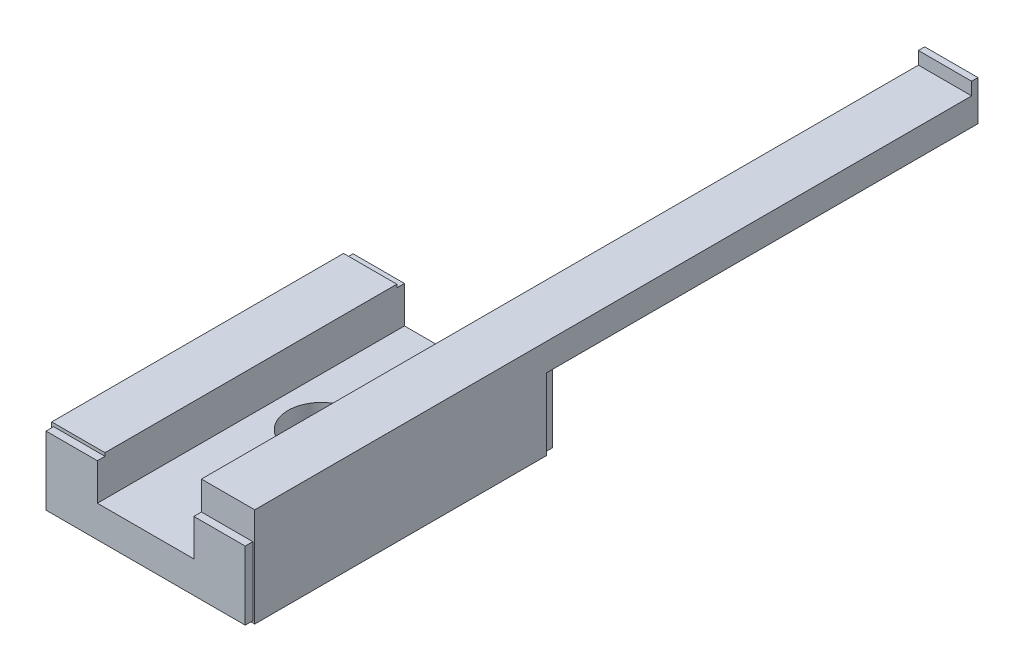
ISO-10303-21;
HEADER;
FILE_DESCRIPTION(('STEP AP214'),'2;1');
FILE_NAME('part.step','',(''),(''),'','','');
FILE_SCHEMA(('AUTOMOTIVE_DESIGN { 1 0 10303 214 1 1 1 1 }'));
ENDSEC;
DATA;
#1=APPLICATION_CONTEXT('core data for automotive mechanical design processes');
#2=APPLICATION_PROTOCOL_DEFINITION('international standard','automotive_design',2000,#1);
#3=PRODUCT_CONTEXT('',#1,'mechanical');
#4=PRODUCT('Part','Part','',(#3));
#5=PRODUCT_RELATED_PRODUCT_CATEGORY('part','',(#4));
#6=PRODUCT_DEFINITION_FORMATION('','',#4);
#7=PRODUCT_DEFINITION_CONTEXT('part definition',#1,'design');
#8=PRODUCT_DEFINITION('design','',#6,#7);
#9=PRODUCT_DEFINITION_SHAPE('','',#8);
#10=(LENGTH_UNIT() NAMED_UNIT(*) SI_UNIT(.MILLI.,.METRE.));
#11=(NAMED_UNIT(*) PLANE_ANGLE_UNIT() SI_UNIT($,.RADIAN.));
#12=(NAMED_UNIT(*) SI_UNIT($,.STERADIAN.) SOLID_ANGLE_UNIT());
#13=UNCERTAINTY_MEASURE_WITH_UNIT(LENGTH_MEASURE(1.E-05),#10,'distance_accuracy_value','');
#14=(GEOMETRIC_REPRESENTATION_CONTEXT(3) GLOBAL_UNCERTAINTY_ASSIGNED_CONTEXT((#13)) GLOBAL_UNIT_ASSIGNED_CONTEXT((#10,
#11,#12)) REPRESENTATION_CONTEXT('',''));
#15=CARTESIAN_POINT('',(0.,0.,0.));
#16=DIRECTION('',(0.,0.,1.));
#17=DIRECTION('',(1.,0.,0.));
#18=AXIS2_PLACEMENT_3D('',#15,#16,#17);
#19=CARTESIAN_POINT('',(7.6,15.6,47.2));
#20=DIRECTION('',(0.,1.,0.));
#21=DIRECTION('',(1.,0.,0.));
#22=AXIS2_PLACEMENT_3D('',#19,#20,#21);
#23=PLANE('',#22);
#24=DIRECTION('',(-1.,0.,0.));
#25=VECTOR('',#24,1.);
#26=CARTESIAN_POINT('',(16.,15.6,-65.8));
#27=LINE('',#26,#25);
#28=CARTESIAN_POINT('',(7.6,15.6,-65.8));
#29=VERTEX_POINT('',#28);
#30=CARTESIAN_POINT('',(16.,15.6,-65.8));
#31=VERTEX_POINT('',#30);
#32=EDGE_CURVE('E197',#29,#31,#27,.F.);
#33=ORIENTED_EDGE('',*,*,#32,.F.);
#34=DIRECTION('',(0.,0.,1.));
#35=VECTOR('',#34,1.);
#36=CARTESIAN_POINT('',(7.6,15.6,-65.8));
#37=LINE('',#36,#35);
#38=CARTESIAN_POINT('',(7.6,15.6,47.2));
#39=VERTEX_POINT('',#38);
#40=EDGE_CURVE('E212',#39,#29,#37,.F.);
#41=ORIENTED_EDGE('',*,*,#40,.F.);
#42=DIRECTION('',(1.,0.,0.));
#43=VECTOR('',#42,1.);
#44=CARTESIAN_POINT('',(7.6,15.6,47.2));
#45=LINE('',#44,#43);
#46=CARTESIAN_POINT('',(16.,15.6,47.2));
#47=VERTEX_POINT('',#46);
#48=EDGE_CURVE('E221',#47,#39,#45,.F.);
#49=ORIENTED_EDGE('',*,*,#48,.F.);
#50=DIRECTION('',(0.,0.,-1.));
#51=VECTOR('',#50,1.);
#52=CARTESIAN_POINT('',(16.,15.6,47.2));
#53=LINE('',#52,#51);
#54=EDGE_CURVE('E214',#47,#31,#53,.T.);
#55=ORIENTED_EDGE('',*,*,#54,.T.);
#56=EDGE_LOOP('',(#33,#41,#49,#55));
#57=FACE_BOUND('',#56,.T.);
#58=ADVANCED_FACE('F16',(#57),#23,.T.);
#59=CARTESIAN_POINT('',(-16.,11.6,47.2));
#60=DIRECTION('',(0.,1.,0.));
#61=DIRECTION('',(1.,0.,0.));
#62=AXIS2_PLACEMENT_3D('',#59,#60,#61);
#63=PLANE('',#62);
#64=DIRECTION('',(1.,0.,0.));
#65=VECTOR('',#64,1.);
#66=CARTESIAN_POINT('',(-16.,11.6,47.2));
#67=LINE('',#66,#65);
#68=CARTESIAN_POINT('',(-7.6,11.6,47.2));
#69=VERTEX_POINT('',#68);
#70=CARTESIAN_POINT('',(-16.,11.6,47.2));
#71=VERTEX_POINT('',#70);
#72=EDGE_CURVE('E232',#69,#71,#67,.F.);
#73=ORIENTED_EDGE('',*,*,#72,.F.);
#74=DIRECTION('',(0.,0.,-1.));
#75=VECTOR('',#74,1.);
#76=CARTESIAN_POINT('',(-7.6,11.6,47.2));
#77=LINE('',#76,#75);
#78=CARTESIAN_POINT('',(-7.6,11.6,1.2));
#79=VERTEX_POINT('',#78);
#80=EDGE_CURVE('E236',#69,#79,#77,.T.);
#81=ORIENTED_EDGE('',*,*,#80,.T.);
#82=DIRECTION('',(-1.,0.,0.));
#83=VECTOR('',#82,1.);
#84=CARTESIAN_POINT('',(-7.6,11.6,1.2));
#85=LINE('',#84,#83);
#86=CARTESIAN_POINT('',(-16.,11.6,1.2));
#87=VERTEX_POINT('',#86);
#88=EDGE_CURVE('E241',#79,#87,#85,.T.);
#89=ORIENTED_EDGE('',*,*,#88,.T.);
#90=DIRECTION('',(0.,0.,1.));
#91=VECTOR('',#90,1.);
#92=CARTESIAN_POINT('',(-16.,11.6,1.2));
#93=LINE('',#92,#91);
#94=EDGE_CURVE('E246',#71,#87,#93,.F.);
#95=ORIENTED_EDGE('',*,*,#94,.F.);
#96=EDGE_LOOP('',(#73,#81,#89,#95));
#97=FACE_BOUND('',#96,.T.);
#98=ADVANCED_FACE('F638',(#97),#63,.T.);
#99=CARTESIAN_POINT('',(-16.,0.,47.2));
#100=DIRECTION('',(-1.,0.,0.));
#101=DIRECTION('',(0.,1.,0.));
#102=AXIS2_PLACEMENT_3D('',#99,#100,#101);
#103=PLANE('',#102);
#104=DIRECTION('',(0.,1.,0.));
#105=VECTOR('',#104,1.);
#106=CARTESIAN_POINT('',(-16.,0.,47.2));
#107=LINE('',#106,#105);
#108=CARTESIAN_POINT('',(-16.,0.,47.2));
#109=VERTEX_POINT('',#108);
#110=EDGE_CURVE('E251',#71,#109,#107,.F.);
#111=ORIENTED_EDGE('',*,*,#110,.F.);
#112=ORIENTED_EDGE('',*,*,#94,.T.);
#113=DIRECTION('',(0.,-1.,0.));
#114=VECTOR('',#113,1.);
#115=CARTESIAN_POINT('',(-16.,11.6,1.2));
#116=LINE('',#115,#114);
#117=CARTESIAN_POINT('',(-16.,0.,1.2));
#118=VERTEX_POINT('',#117);
#119=EDGE_CURVE('E255',#87,#118,#116,.T.);
#120=ORIENTED_EDGE('',*,*,#119,.T.);
#121=DIRECTION('',(0.,0.,1.));
#122=VECTOR('',#121,1.);
#123=CARTESIAN_POINT('',(-16.,0.,1.2));
#124=LINE('',#123,#122);
#125=EDGE_CURVE('E260',#109,#118,#124,.F.);
#126=ORIENTED_EDGE('',*,*,#125,.F.);
#127=EDGE_LOOP('',(#111,#112,#120,#126));
#128=FACE_BOUND('',#127,.T.);
#129=ADVANCED_FACE('F643',(#128),#103,.T.);
#130=CARTESIAN_POINT('',(-16.,0.,1.2));
#131=DIRECTION('',(0.,-1.,0.));
#132=DIRECTION('',(1.,0.,0.));
#133=AXIS2_PLACEMENT_3D('',#130,#131,#132);
#134=PLANE('',#133);
#135=DIRECTION('',(-1.,0.,0.));
#136=VECTOR('',#135,1.);
#137=CARTESIAN_POINT('',(-8.,0.,47.2));
#138=LINE('',#137,#136);
#139=CARTESIAN_POINT('',(-8.,0.,47.2));
#140=VERTEX_POINT('',#139);
#141=EDGE_CURVE('E265',#109,#140,#138,.F.);
#142=ORIENTED_EDGE('',*,*,#141,.F.);
#143=ORIENTED_EDGE('',*,*,#125,.T.);
#144=DIRECTION('',(1.,0.,0.));
#145=VECTOR('',#144,1.);
#146=CARTESIAN_POINT('',(-16.,0.,1.2));
#147=LINE('',#146,#145);
#148=CARTESIAN_POINT('',(-8.,0.,1.2));
#149=VERTEX_POINT('',#148);
#150=EDGE_CURVE('E269',#118,#149,#147,.T.);
#151=ORIENTED_EDGE('',*,*,#150,.T.);
#152=DIRECTION('',(0.,0.,1.));
#153=VECTOR('',#152,1.);
#154=CARTESIAN_POINT('',(-8.,0.,1.2));
#155=LINE('',#154,#153);
#156=EDGE_CURVE('E274',#140,#149,#155,.F.);
#157=ORIENTED_EDGE('',*,*,#156,.F.);
#158=EDGE_LOOP('',(#142,#143,#151,#157));
#159=FACE_BOUND('',#158,.T.);
#160=CARTESIAN_POINT('',(-12.,0.,9.2));
#161=DIRECTION('',(0.,1.,0.));
#162=DIRECTION('',(0.,0.,-1.));
#163=AXIS2_PLACEMENT_3D('',#160,#161,#162);
#164=CIRCLE('',#163,2.);
#165=CARTESIAN_POINT('',(-12.,0.,7.2));
#166=VERTEX_POINT('',#165);
#167=EDGE_CURVE('E279',#166,#166,#164,.F.);
#168=ORIENTED_EDGE('',*,*,#167,.F.);
#169=EDGE_LOOP('',(#168));
#170=FACE_BOUND('',#169,.T.);
#171=CARTESIAN_POINT('',(-12.,0.,39.2));
#172=DIRECTION('',(0.,1.,0.));
#173=DIRECTION('',(0.,0.,-1.));
#174=AXIS2_PLACEMENT_3D('',#171,#172,#173);
#175=CIRCLE('',#174,2.);
#176=CARTESIAN_POINT('',(-12.,0.,37.2));
#177=VERTEX_POINT('',#176);
#178=EDGE_CURVE('E284',#177,#177,#175,.F.);
#179=ORIENTED_EDGE('',*,*,#178,.F.);
#180=EDGE_LOOP('',(#179));
#181=FACE_BOUND('',#180,.T.);
#182=ADVANCED_FACE('F649',(#159,#170,#181),#134,.T.);
#183=CARTESIAN_POINT('',(-7.7,0.300000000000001,1.2));
#184=DIRECTION('',(0.707106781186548,-0.707106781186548,0.));
#185=DIRECTION('',(0.,0.,1.));
#186=AXIS2_PLACEMENT_3D('',#183,#184,#185);
#187=PLANE('',#186);
#188=DIRECTION('',(-0.707106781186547,-0.707106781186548,0.));
#189=VECTOR('',#188,1.);
#190=CARTESIAN_POINT('',(-7.7,0.300000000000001,47.2));
#191=LINE('',#190,#189);
#192=CARTESIAN_POINT('',(-7.7,0.300000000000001,47.2));
#193=VERTEX_POINT('',#192);
#194=EDGE_CURVE('E287',#140,#193,#191,.F.);
#195=ORIENTED_EDGE('',*,*,#194,.F.);
#196=ORIENTED_EDGE('',*,*,#156,.T.);
#197=DIRECTION('',(0.707106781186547,0.707106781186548,0.));
#198=VECTOR('',#197,1.);
#199=CARTESIAN_POINT('',(-8.,0.,1.2));
#200=LINE('',#199,#198);
#201=CARTESIAN_POINT('',(-7.7,0.300000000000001,1.2));
#202=VERTEX_POINT('',#201);
#203=EDGE_CURVE('E289',#149,#202,#200,.T.);
#204=ORIENTED_EDGE('',*,*,#203,.T.);
#205=DIRECTION('',(0.,0.,1.));
#206=VECTOR('',#205,1.);
#207=CARTESIAN_POINT('',(-7.7,0.300000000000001,1.2));
#208=LINE('',#207,#206);
#209=EDGE_CURVE('E294',#193,#202,#208,.F.);
#210=ORIENTED_EDGE('',*,*,#209,.F.);
#211=EDGE_LOOP('',(#195,#196,#204,#210));
#212=FACE_BOUND('',#211,.T.);
#213=ADVANCED_FACE('F653',(#212),#187,.T.);
#214=CARTESIAN_POINT('',(8.,0.,1.2));
#215=DIRECTION('',(-0.707106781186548,-0.707106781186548,0.));
#216=DIRECTION('',(0.,0.,1.));
#217=AXIS2_PLACEMENT_3D('',#214,#215,#216);
#218=PLANE('',#217);
#219=DIRECTION('',(-0.707106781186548,0.707106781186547,0.));
#220=VECTOR('',#219,1.);
#221=CARTESIAN_POINT('',(8.,0.,47.2));
#222=LINE('',#221,#220);
#223=CARTESIAN_POINT('',(7.7,0.3,47.2));
#224=VERTEX_POINT('',#223);
#225=CARTESIAN_POINT('',(8.,0.,47.2));
#226=VERTEX_POINT('',#225);
#227=EDGE_CURVE('E299',#224,#226,#222,.F.);
#228=ORIENTED_EDGE('',*,*,#227,.F.);
#229=DIRECTION('',(0.,0.,-1.));
#230=VECTOR('',#229,1.);
#231=CARTESIAN_POINT('',(7.7,0.3,47.2));
#232=LINE('',#231,#230);
#233=CARTESIAN_POINT('',(7.7,0.299999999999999,1.2));
#234=VERTEX_POINT('',#233);
#235=EDGE_CURVE('E303',#224,#234,#232,.T.);
#236=ORIENTED_EDGE('',*,*,#235,.T.);
#237=DIRECTION('',(0.707106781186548,-0.707106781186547,0.));
#238=VECTOR('',#237,1.);
#239=CARTESIAN_POINT('',(7.7,0.299999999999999,1.2));
#240=LINE('',#239,#238);
#241=CARTESIAN_POINT('',(8.,0.,1.2));
#242=VERTEX_POINT('',#241);
#243=EDGE_CURVE('E308',#234,#242,#240,.T.);
#244=ORIENTED_EDGE('',*,*,#243,.T.);
#245=DIRECTION('',(0.,0.,1.));
#246=VECTOR('',#245,1.);
#247=CARTESIAN_POINT('',(8.,0.,1.2));
#248=LINE('',#247,#246);
#249=EDGE_CURVE('E313',#226,#242,#248,.F.);
#250=ORIENTED_EDGE('',*,*,#249,.F.);
#251=EDGE_LOOP('',(#228,#236,#244,#250));
#252=FACE_BOUND('',#251,.T.);
#253=ADVANCED_FACE('F657',(#252),#218,.T.);
#254=CARTESIAN_POINT('',(8.,0.,1.2));
#255=DIRECTION('',(0.,-1.,0.));
#256=DIRECTION('',(1.,0.,0.));
#257=AXIS2_PLACEMENT_3D('',#254,#255,#256);
#258=PLANE('',#257);
#259=DIRECTION('',(-1.,0.,0.));
#260=VECTOR('',#259,1.);
#261=CARTESIAN_POINT('',(16.,0.,47.2));
#262=LINE('',#261,#260);
#263=CARTESIAN_POINT('',(16.,0.,47.2));
#264=VERTEX_POINT('',#263);
#265=EDGE_CURVE('E318',#226,#264,#262,.F.);
#266=ORIENTED_EDGE('',*,*,#265,.F.);
#267=ORIENTED_EDGE('',*,*,#249,.T.);
#268=DIRECTION('',(1.,0.,0.));
#269=VECTOR('',#268,1.);
#270=CARTESIAN_POINT('',(8.,0.,1.2));
#271=LINE('',#270,#269);
#272=CARTESIAN_POINT('',(16.,0.,1.2));
#273=VERTEX_POINT('',#272);
#274=EDGE_CURVE('E322',#242,#273,#271,.T.);
#275=ORIENTED_EDGE('',*,*,#274,.T.);
#276=DIRECTION('',(0.,0.,1.));
#277=VECTOR('',#276,1.);
#278=CARTESIAN_POINT('',(16.,0.,1.2));
#279=LINE('',#278,#277);
#280=EDGE_CURVE('E327',#264,#273,#279,.F.);
#281=ORIENTED_EDGE('',*,*,#280,.F.);
#282=EDGE_LOOP('',(#266,#267,#275,#281));
#283=FACE_BOUND('',#282,.T.);
#284=CARTESIAN_POINT('',(12.,0.,9.2));
#285=DIRECTION('',(0.,1.,0.));
#286=DIRECTION('',(0.,0.,-1.));
#287=AXIS2_PLACEMENT_3D('',#284,#285,#286);
#288=CIRCLE('',#287,2.);
#289=CARTESIAN_POINT('',(12.,0.,7.2));
#290=VERTEX_POINT('',#289);
#291=EDGE_CURVE('E332',#290,#290,#288,.F.);
#292=ORIENTED_EDGE('',*,*,#291,.F.);
#293=EDGE_LOOP('',(#292));
#294=FACE_BOUND('',#293,.T.);
#295=CARTESIAN_POINT('',(12.,0.,39.2));
#296=DIRECTION('',(0.,1.,0.));
#297=DIRECTION('',(0.,0.,-1.));
#298=AXIS2_PLACEMENT_3D('',#295,#296,#297);
#299=CIRCLE('',#298,2.);
#300=CARTESIAN_POINT('',(12.,0.,37.2));
#301=VERTEX_POINT('',#300);
#302=EDGE_CURVE('E337',#301,#301,#299,.F.);
#303=ORIENTED_EDGE('',*,*,#302,.F.);
#304=EDGE_LOOP('',(#303));
#305=FACE_BOUND('',#304,.T.);
#306=ADVANCED_FACE('F661',(#283,#294,#305),#258,.T.);
#307=CARTESIAN_POINT('',(16.,0.,-66.8));
#308=DIRECTION('',(1.,0.,0.));
#309=DIRECTION('',(0.,1.,0.));
#310=AXIS2_PLACEMENT_3D('',#307,#308,#309);
#311=PLANE('',#310);
#312=DIRECTION('',(0.,-1.,0.));
#313=VECTOR('',#312,1.);
#314=CARTESIAN_POINT('',(16.,15.6,47.2));
#315=LINE('',#314,#313);
#316=EDGE_CURVE('E340',#264,#47,#315,.F.);
#317=ORIENTED_EDGE('',*,*,#316,.F.);
#318=ORIENTED_EDGE('',*,*,#280,.T.);
#319=DIRECTION('',(0.,1.,0.));
#320=VECTOR('',#319,1.);
#321=CARTESIAN_POINT('',(16.,0.,1.2));
#322=LINE('',#321,#320);
#323=CARTESIAN_POINT('',(16.,11.3,1.2));
#324=VERTEX_POINT('',#323);
#325=EDGE_CURVE('E342',#273,#324,#322,.T.);
#326=ORIENTED_EDGE('',*,*,#325,.T.);
#327=DIRECTION('',(0.,0.,-1.));
#328=VECTOR('',#327,1.);
#329=CARTESIAN_POINT('',(16.,11.3,1.2));
#330=LINE('',#329,#328);
#331=CARTESIAN_POINT('',(16.,11.3,-66.8));
#332=VERTEX_POINT('',#331);
#333=EDGE_CURVE('E347',#332,#324,#330,.F.);
#334=ORIENTED_EDGE('',*,*,#333,.F.);
#335=DIRECTION('',(0.,1.,0.));
#336=VECTOR('',#335,1.);
#337=CARTESIAN_POINT('',(16.,11.3,-66.8));
#338=LINE('',#337,#336);
#339=CARTESIAN_POINT('',(16.,17.6,-66.8));
#340=VERTEX_POINT('',#339);
#341=EDGE_CURVE('E351',#332,#340,#338,.T.);
#342=ORIENTED_EDGE('',*,*,#341,.T.);
#343=DIRECTION('',(0.,0.,1.));
#344=VECTOR('',#343,1.);
#345=CARTESIAN_POINT('',(16.,17.6,-66.8));
#346=LINE('',#345,#344);
#347=CARTESIAN_POINT('',(16.,17.6,-65.8));
#348=VERTEX_POINT('',#347);
#349=EDGE_CURVE('E356',#348,#340,#346,.F.);
#350=ORIENTED_EDGE('',*,*,#349,.F.);
#351=DIRECTION('',(0.,-1.,0.));
#352=VECTOR('',#351,1.);
#353=CARTESIAN_POINT('',(16.,17.6,-65.8));
#354=LINE('',#353,#352);
#355=EDGE_CURVE('E360',#31,#348,#354,.F.);
#356=ORIENTED_EDGE('',*,*,#355,.F.);
#357=ORIENTED_EDGE('',*,*,#54,.F.);
#358=EDGE_LOOP('',(#317,#318,#326,#334,#342,#350,#356,#357));
#359=FACE_BOUND('',#358,.T.);
#360=ADVANCED_FACE('F665',(#359),#311,.T.);
#361=CARTESIAN_POINT('',(7.6,5.3,48.4));
#362=DIRECTION('',(-1.,0.,0.));
#363=DIRECTION('',(0.,1.,0.));
#364=AXIS2_PLACEMENT_3D('',#361,#362,#363);
#365=PLANE('',#364);
#366=DIRECTION('',(0.,0.,1.));
#367=VECTOR('',#366,1.);
#368=CARTESIAN_POINT('',(7.6,11.3,-66.8));
#369=LINE('',#368,#367);
#370=CARTESIAN_POINT('',(7.6,11.3,-66.8));
#371=VERTEX_POINT('',#370);
#372=CARTESIAN_POINT('',(7.6,11.3,0.));
#373=VERTEX_POINT('',#372);
#374=EDGE_CURVE('E364',#371,#373,#369,.T.);
#375=ORIENTED_EDGE('',*,*,#374,.T.);
#376=DIRECTION('',(0.,-1.,0.));
#377=VECTOR('',#376,1.);
#378=CARTESIAN_POINT('',(7.6,11.3,0.));
#379=LINE('',#378,#377);
#380=CARTESIAN_POINT('',(7.6,5.3,0.));
#381=VERTEX_POINT('',#380);
#382=EDGE_CURVE('E368',#373,#381,#379,.T.);
#383=ORIENTED_EDGE('',*,*,#382,.T.);
#384=DIRECTION('',(0.,0.,1.));
#385=VECTOR('',#384,1.);
#386=CARTESIAN_POINT('',(7.6,5.3,0.));
#387=LINE('',#386,#385);
#388=CARTESIAN_POINT('',(7.6,5.3,48.4));
#389=VERTEX_POINT('',#388);
#390=EDGE_CURVE('E373',#389,#381,#387,.F.);
#391=ORIENTED_EDGE('',*,*,#390,.F.);
#392=DIRECTION('',(0.,1.,0.));
#393=VECTOR('',#392,1.);
#394=CARTESIAN_POINT('',(7.6,5.3,48.4));
#395=LINE('',#394,#393);
#396=CARTESIAN_POINT('',(7.6,11.1,48.4));
#397=VERTEX_POINT('',#396);
#398=EDGE_CURVE('E377',#397,#389,#395,.F.);
#399=ORIENTED_EDGE('',*,*,#398,.F.);
#400=DIRECTION('',(0.,0.,-1.));
#401=VECTOR('',#400,1.);
#402=CARTESIAN_POINT('',(7.6,11.1,48.4));
#403=LINE('',#402,#401);
#404=CARTESIAN_POINT('',(7.6,11.1,47.2));
#405=VERTEX_POINT('',#404);
#406=EDGE_CURVE('E381',#405,#397,#403,.F.);
#407=ORIENTED_EDGE('',*,*,#406,.F.);
#408=DIRECTION('',(0.,1.,0.));
#409=VECTOR('',#408,1.);
#410=CARTESIAN_POINT('',(7.6,11.1,47.2));
#411=LINE('',#410,#409);
#412=EDGE_CURVE('E206',#39,#405,#411,.F.);
#413=ORIENTED_EDGE('',*,*,#412,.F.);
#414=ORIENTED_EDGE('',*,*,#40,.T.);
#415=DIRECTION('',(0.,1.,0.));
#416=VECTOR('',#415,1.);
#417=CARTESIAN_POINT('',(7.6,15.6,-65.8));
#418=LINE('',#417,#416);
#419=CARTESIAN_POINT('',(7.6,17.6,-65.8));
#420=VERTEX_POINT('',#419);
#421=EDGE_CURVE('E194',#420,#29,#418,.F.);
#422=ORIENTED_EDGE('',*,*,#421,.F.);
#423=DIRECTION('',(0.,0.,-1.));
#424=VECTOR('',#423,1.);
#425=CARTESIAN_POINT('',(7.6,17.6,-65.8));
#426=LINE('',#425,#424);
#427=CARTESIAN_POINT('',(7.6,17.6,-66.8));
#428=VERTEX_POINT('',#427);
#429=EDGE_CURVE('E205',#420,#428,#426,.T.);
#430=ORIENTED_EDGE('',*,*,#429,.T.);
#431=DIRECTION('',(0.,-1.,0.));
#432=VECTOR('',#431,1.);
#433=CARTESIAN_POINT('',(7.6,17.6,-66.8));
#434=LINE('',#433,#432);
#435=EDGE_CURVE('E393',#428,#371,#434,.T.);
#436=ORIENTED_EDGE('',*,*,#435,.T.);
#437=EDGE_LOOP('',(#375,#383,#391,#399,#407,#413,#414,#422,#430,#436));
#438=FACE_BOUND('',#437,.T.);
#439=ADVANCED_FACE('F218',(#438),#365,.T.);
#440=CARTESIAN_POINT('',(-7.6,5.3,0.));
#441=DIRECTION('',(1.,0.,0.));
#442=DIRECTION('',(0.,1.,0.));
#443=AXIS2_PLACEMENT_3D('',#440,#441,#442);
#444=PLANE('',#443);
#445=DIRECTION('',(0.,-1.,0.));
#446=VECTOR('',#445,1.);
#447=CARTESIAN_POINT('',(-7.6,11.6,47.2));
#448=LINE('',#447,#446);
#449=CARTESIAN_POINT('',(-7.6,11.1,47.2));
#450=VERTEX_POINT('',#449);
#451=EDGE_CURVE('E398',#450,#69,#448,.F.);
#452=ORIENTED_EDGE('',*,*,#451,.F.);
#453=DIRECTION('',(0.,0.,1.));
#454=VECTOR('',#453,1.);
#455=CARTESIAN_POINT('',(-7.6,11.1,47.2));
#456=LINE('',#455,#454);
#457=CARTESIAN_POINT('',(-7.6,11.1,48.4));
#458=VERTEX_POINT('',#457);
#459=EDGE_CURVE('E402',#450,#458,#456,.T.);
#460=ORIENTED_EDGE('',*,*,#459,.T.);
#461=DIRECTION('',(0.,-1.,0.));
#462=VECTOR('',#461,1.);
#463=CARTESIAN_POINT('',(-7.6,11.1,48.4));
#464=LINE('',#463,#462);
#465=CARTESIAN_POINT('',(-7.6,5.3,48.4));
#466=VERTEX_POINT('',#465);
#467=EDGE_CURVE('E407',#466,#458,#464,.F.);
#468=ORIENTED_EDGE('',*,*,#467,.F.);
#469=DIRECTION('',(0.,0.,-1.));
#470=VECTOR('',#469,1.);
#471=CARTESIAN_POINT('',(-7.6,5.3,48.4));
#472=LINE('',#471,#470);
#473=CARTESIAN_POINT('',(-7.6,5.3,0.));
#474=VERTEX_POINT('',#473);
#475=EDGE_CURVE('E412',#466,#474,#472,.T.);
#476=ORIENTED_EDGE('',*,*,#475,.T.);
#477=DIRECTION('',(0.,1.,0.));
#478=VECTOR('',#477,1.);
#479=CARTESIAN_POINT('',(-7.6,5.3,0.));
#480=LINE('',#479,#478);
#481=CARTESIAN_POINT('',(-7.6,11.1,0.));
#482=VERTEX_POINT('',#481);
#483=EDGE_CURVE('E417',#474,#482,#480,.T.);
#484=ORIENTED_EDGE('',*,*,#483,.T.);
#485=DIRECTION('',(0.,0.,1.));
#486=VECTOR('',#485,1.);
#487=CARTESIAN_POINT('',(-7.6,11.1,0.));
#488=LINE('',#487,#486);
#489=CARTESIAN_POINT('',(-7.6,11.1,1.2));
#490=VERTEX_POINT('',#489);
#491=EDGE_CURVE('E422',#490,#482,#488,.F.);
#492=ORIENTED_EDGE('',*,*,#491,.F.);
#493=DIRECTION('',(0.,1.,0.));
#494=VECTOR('',#493,1.);
#495=CARTESIAN_POINT('',(-7.6,11.1,1.2));
#496=LINE('',#495,#494);
#497=EDGE_CURVE('E426',#490,#79,#496,.T.);
#498=ORIENTED_EDGE('',*,*,#497,.T.);
#499=ORIENTED_EDGE('',*,*,#80,.F.);
#500=EDGE_LOOP('',(#452,#460,#468,#476,#484,#492,#498,#499));
#501=FACE_BOUND('',#500,.T.);
#502=ADVANCED_FACE('F672',(#501),#444,.T.);
#503=CARTESIAN_POINT('',(-15.7,0.3,0.));
#504=DIRECTION('',(0.,0.,-1.));
#505=DIRECTION('',(0.,1.,0.));
#506=AXIS2_PLACEMENT_3D('',#503,#504,#505);
#507=PLANE('',#506);
#508=ORIENTED_EDGE('',*,*,#382,.F.);
#509=DIRECTION('',(1.,0.,0.));
#510=VECTOR('',#509,1.);
#511=CARTESIAN_POINT('',(7.6,11.3,0.));
#512=LINE('',#511,#510);
#513=CARTESIAN_POINT('',(15.7,11.3,0.));
#514=VERTEX_POINT('',#513);
#515=EDGE_CURVE('E431',#373,#514,#512,.T.);
#516=ORIENTED_EDGE('',*,*,#515,.T.);
#517=DIRECTION('',(0.,-1.,0.));
#518=VECTOR('',#517,1.);
#519=CARTESIAN_POINT('',(15.7,11.3,0.));
#520=LINE('',#519,#518);
#521=CARTESIAN_POINT('',(15.7,0.300000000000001,0.));
#522=VERTEX_POINT('',#521);
#523=EDGE_CURVE('E436',#514,#522,#520,.T.);
#524=ORIENTED_EDGE('',*,*,#523,.T.);
#525=DIRECTION('',(-1.,0.,0.));
#526=VECTOR('',#525,1.);
#527=CARTESIAN_POINT('',(15.7,0.3,0.));
#528=LINE('',#527,#526);
#529=CARTESIAN_POINT('',(-15.7,0.3,0.));
#530=VERTEX_POINT('',#529);
#531=EDGE_CURVE('E441',#530,#522,#528,.F.);
#532=ORIENTED_EDGE('',*,*,#531,.F.);
#533=DIRECTION('',(0.,1.,0.));
#534=VECTOR('',#533,1.);
#535=CARTESIAN_POINT('',(-15.7,0.3,0.));
#536=LINE('',#535,#534);
#537=CARTESIAN_POINT('',(-15.7,11.1,0.));
#538=VERTEX_POINT('',#537);
#539=EDGE_CURVE('E446',#530,#538,#536,.T.);
#540=ORIENTED_EDGE('',*,*,#539,.T.);
#541=DIRECTION('',(1.,0.,0.));
#542=VECTOR('',#541,1.);
#543=CARTESIAN_POINT('',(-15.7,11.1,0.));
#544=LINE('',#543,#542);
#545=EDGE_CURVE('E451',#538,#482,#544,.T.);
#546=ORIENTED_EDGE('',*,*,#545,.T.);
#547=ORIENTED_EDGE('',*,*,#483,.F.);
#548=DIRECTION('',(1.,0.,0.));
#549=VECTOR('',#548,1.);
#550=CARTESIAN_POINT('',(-7.6,5.3,0.));
#551=LINE('',#550,#549);
#552=EDGE_CURVE('E456',#381,#474,#551,.F.);
#553=ORIENTED_EDGE('',*,*,#552,.F.);
#554=EDGE_LOOP('',(#508,#516,#524,#532,#540,#546,#547,#553));
#555=FACE_BOUND('',#554,.T.);
#556=ADVANCED_FACE('F675',(#555),#507,.T.);
#557=CARTESIAN_POINT('',(-15.7,0.3,0.));
#558=DIRECTION('',(0.,-1.,0.));
#559=DIRECTION('',(1.,0.,0.));
#560=AXIS2_PLACEMENT_3D('',#557,#558,#559);
#561=PLANE('',#560);
#562=DIRECTION('',(-1.,0.,0.));
#563=VECTOR('',#562,1.);
#564=CARTESIAN_POINT('',(15.7,0.3,48.4));
#565=LINE('',#564,#563);
#566=CARTESIAN_POINT('',(-15.7,0.3,48.4));
#567=VERTEX_POINT('',#566);
#568=CARTESIAN_POINT('',(15.7,0.3,48.4));
#569=VERTEX_POINT('',#568);
#570=EDGE_CURVE('E460',#567,#569,#565,.F.);
#571=ORIENTED_EDGE('',*,*,#570,.F.);
#572=DIRECTION('',(0.,0.,-1.));
#573=VECTOR('',#572,1.);
#574=CARTESIAN_POINT('',(-15.7,0.3,48.4));
#575=LINE('',#574,#573);
#576=CARTESIAN_POINT('',(-15.7,0.3,47.2));
#577=VERTEX_POINT('',#576);
#578=EDGE_CURVE('E465',#577,#567,#575,.F.);
#579=ORIENTED_EDGE('',*,*,#578,.F.);
#580=DIRECTION('',(1.,0.,0.));
#581=VECTOR('',#580,1.);
#582=CARTESIAN_POINT('',(-15.7,0.3,47.2));
#583=LINE('',#582,#581);
#584=EDGE_CURVE('E469',#193,#577,#583,.F.);
#585=ORIENTED_EDGE('',*,*,#584,.F.);
#586=ORIENTED_EDGE('',*,*,#209,.T.);
#587=DIRECTION('',(-1.,0.,0.));
#588=VECTOR('',#587,1.);
#589=CARTESIAN_POINT('',(-7.7,0.3,1.2));
#590=LINE('',#589,#588);
#591=CARTESIAN_POINT('',(-15.7,0.3,1.2));
#592=VERTEX_POINT('',#591);
#593=EDGE_CURVE('E473',#202,#592,#590,.T.);
#594=ORIENTED_EDGE('',*,*,#593,.T.);
#595=DIRECTION('',(0.,0.,-1.));
#596=VECTOR('',#595,1.);
#597=CARTESIAN_POINT('',(-15.7,0.3,1.2));
#598=LINE('',#597,#596);
#599=EDGE_CURVE('E478',#592,#530,#598,.T.);
#600=ORIENTED_EDGE('',*,*,#599,.T.);
#601=ORIENTED_EDGE('',*,*,#531,.T.);
#602=DIRECTION('',(0.,0.,1.));
#603=VECTOR('',#602,1.);
#604=CARTESIAN_POINT('',(15.7,0.3,0.));
#605=LINE('',#604,#603);
#606=CARTESIAN_POINT('',(15.7,0.3,1.2));
#607=VERTEX_POINT('',#606);
#608=EDGE_CURVE('E483',#607,#522,#605,.F.);
#609=ORIENTED_EDGE('',*,*,#608,.F.);
#610=DIRECTION('',(-1.,0.,0.));
#611=VECTOR('',#610,1.);
#612=CARTESIAN_POINT('',(15.7,0.3,1.2));
#613=LINE('',#612,#611);
#614=EDGE_CURVE('E487',#607,#234,#613,.T.);
#615=ORIENTED_EDGE('',*,*,#614,.T.);
#616=ORIENTED_EDGE('',*,*,#235,.F.);
#617=DIRECTION('',(1.,0.,0.));
#618=VECTOR('',#617,1.);
#619=CARTESIAN_POINT('',(7.7,0.3,47.2));
#620=LINE('',#619,#618);
#621=CARTESIAN_POINT('',(15.7,0.3,47.2));
#622=VERTEX_POINT('',#621);
#623=EDGE_CURVE('E492',#622,#224,#620,.F.);
#624=ORIENTED_EDGE('',*,*,#623,.F.);
#625=DIRECTION('',(0.,0.,1.));
#626=VECTOR('',#625,1.);
#627=CARTESIAN_POINT('',(15.7,0.3,47.2));
#628=LINE('',#627,#626);
#629=EDGE_CURVE('E496',#622,#569,#628,.T.);
#630=ORIENTED_EDGE('',*,*,#629,.T.);
#631=EDGE_LOOP('',(#571,#579,#585,#586,#594,#600,#601,#609,#615,#616,#624,#630));
#632=FACE_BOUND('',#631,.T.);
#633=CARTESIAN_POINT('',(0.,0.3,20.7));
#634=DIRECTION('',(0.,1.,0.));
#635=DIRECTION('',(0.,0.,-1.));
#636=AXIS2_PLACEMENT_3D('',#633,#634,#635);
#637=CIRCLE('',#636,5.25);
#638=CARTESIAN_POINT('',(0.,0.3,15.45));
#639=VERTEX_POINT('',#638);
#640=EDGE_CURVE('E501',#639,#639,#637,.F.);
#641=ORIENTED_EDGE('',*,*,#640,.F.);
#642=EDGE_LOOP('',(#641));
#643=FACE_BOUND('',#642,.T.);
#644=CARTESIAN_POINT('',(0.,0.3,39.2));
#645=DIRECTION('',(0.,1.,0.));
#646=DIRECTION('',(-1.42053996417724E-07,0.,-0.99999999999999));
#647=AXIS2_PLACEMENT_3D('',#644,#645,#646);
#648=CIRCLE('',#647,1.5);
#649=CARTESIAN_POINT('',(-2.13080994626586E-07,0.3,37.7));
#650=VERTEX_POINT('',#649);
#651=EDGE_CURVE('E506',#650,#650,#648,.F.);
#652=ORIENTED_EDGE('',*,*,#651,.F.);
#653=EDGE_LOOP('',(#652));
#654=FACE_BOUND('',#653,.T.);
#655=ADVANCED_FACE('F679',(#632,#643,#654),#561,.T.);
#656=CARTESIAN_POINT('',(-7.6,5.3,48.4));
#657=DIRECTION('',(0.,1.,0.));
#658=DIRECTION('',(1.,0.,0.));
#659=AXIS2_PLACEMENT_3D('',#656,#657,#658);
#660=PLANE('',#659);
#661=ORIENTED_EDGE('',*,*,#552,.T.);
#662=ORIENTED_EDGE('',*,*,#475,.F.);
#663=DIRECTION('',(1.,0.,0.));
#664=VECTOR('',#663,1.);
#665=CARTESIAN_POINT('',(-7.6,5.3,48.4));
#666=LINE('',#665,#664);
#667=EDGE_CURVE('E509',#389,#466,#666,.F.);
#668=ORIENTED_EDGE('',*,*,#667,.F.);
#669=ORIENTED_EDGE('',*,*,#390,.T.);
#670=EDGE_LOOP('',(#661,#662,#668,#669));
#671=FACE_BOUND('',#670,.T.);
#672=CARTESIAN_POINT('',(0.,5.3,20.7));
#673=DIRECTION('',(0.,-1.,0.));
#674=DIRECTION('',(0.,0.,1.));
#675=AXIS2_PLACEMENT_3D('',#672,#673,#674);
#676=CIRCLE('',#675,5.25);
#677=CARTESIAN_POINT('',(0.,5.3,25.95));
#678=VERTEX_POINT('',#677);
#679=EDGE_CURVE('E511',#678,#678,#676,.F.);
#680=ORIENTED_EDGE('',*,*,#679,.F.);
#681=EDGE_LOOP('',(#680));
#682=FACE_BOUND('',#681,.T.);
#683=ADVANCED_FACE('F683',(#671,#682),#660,.T.);
#684=CARTESIAN_POINT('',(-15.7,0.3,48.4));
#685=DIRECTION('',(0.,0.,1.));
#686=DIRECTION('',(1.,0.,0.));
#687=AXIS2_PLACEMENT_3D('',#684,#685,#686);
#688=PLANE('',#687);
#689=DIRECTION('',(-1.,0.,0.));
#690=VECTOR('',#689,1.);
#691=CARTESIAN_POINT('',(15.7,11.1,48.4));
#692=LINE('',#691,#690);
#693=CARTESIAN_POINT('',(15.7,11.1,48.4));
#694=VERTEX_POINT('',#693);
#695=EDGE_CURVE('E516',#397,#694,#692,.F.);
#696=ORIENTED_EDGE('',*,*,#695,.F.);
#697=ORIENTED_EDGE('',*,*,#398,.T.);
#698=ORIENTED_EDGE('',*,*,#667,.T.);
#699=ORIENTED_EDGE('',*,*,#467,.T.);
#700=DIRECTION('',(-1.,0.,0.));
#701=VECTOR('',#700,1.);
#702=CARTESIAN_POINT('',(-7.6,11.1,48.4));
#703=LINE('',#702,#701);
#704=CARTESIAN_POINT('',(-15.7,11.1,48.4));
#705=VERTEX_POINT('',#704);
#706=EDGE_CURVE('E519',#705,#458,#703,.F.);
#707=ORIENTED_EDGE('',*,*,#706,.F.);
#708=DIRECTION('',(0.,-1.,0.));
#709=VECTOR('',#708,1.);
#710=CARTESIAN_POINT('',(-15.7,11.1,48.4));
#711=LINE('',#710,#709);
#712=EDGE_CURVE('E523',#567,#705,#711,.F.);
#713=ORIENTED_EDGE('',*,*,#712,.F.);
#714=ORIENTED_EDGE('',*,*,#570,.T.);
#715=DIRECTION('',(0.,1.,0.));
#716=VECTOR('',#715,1.);
#717=CARTESIAN_POINT('',(15.7,0.300000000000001,48.4));
#718=LINE('',#717,#716);
#719=EDGE_CURVE('E527',#694,#569,#718,.F.);
#720=ORIENTED_EDGE('',*,*,#719,.F.);
#721=EDGE_LOOP('',(#696,#697,#698,#699,#707,#713,#714,#720));
#722=FACE_BOUND('',#721,.T.);
#723=ADVANCED_FACE('F687',(#722),#688,.T.);
#724=CARTESIAN_POINT('',(-15.7,11.1,0.));
#725=DIRECTION('',(0.,1.,0.));
#726=DIRECTION('',(0.,0.,1.));
#727=AXIS2_PLACEMENT_3D('',#724,#725,#726);
#728=PLANE('',#727);
#729=ORIENTED_EDGE('',*,*,#545,.F.);
#730=DIRECTION('',(0.,0.,1.));
#731=VECTOR('',#730,1.);
#732=CARTESIAN_POINT('',(-15.7,11.1,0.));
#733=LINE('',#732,#731);
#734=CARTESIAN_POINT('',(-15.7,11.1,1.2));
#735=VERTEX_POINT('',#734);
#736=EDGE_CURVE('E531',#735,#538,#733,.F.);
#737=ORIENTED_EDGE('',*,*,#736,.F.);
#738=DIRECTION('',(1.,0.,0.));
#739=VECTOR('',#738,1.);
#740=CARTESIAN_POINT('',(-15.7,11.1,1.2));
#741=LINE('',#740,#739);
#742=EDGE_CURVE('E535',#735,#490,#741,.T.);
#743=ORIENTED_EDGE('',*,*,#742,.T.);
#744=ORIENTED_EDGE('',*,*,#491,.T.);
#745=EDGE_LOOP('',(#729,#737,#743,#744));
#746=FACE_BOUND('',#745,.T.);
#747=ADVANCED_FACE('F691',(#746),#728,.T.);
#748=CARTESIAN_POINT('',(-15.7,0.3,0.));
#749=DIRECTION('',(-1.,0.,0.));
#750=DIRECTION('',(0.,0.,1.));
#751=AXIS2_PLACEMENT_3D('',#748,#749,#750);
#752=PLANE('',#751);
#753=ORIENTED_EDGE('',*,*,#539,.F.);
#754=ORIENTED_EDGE('',*,*,#599,.F.);
#755=DIRECTION('',(0.,1.,0.));
#756=VECTOR('',#755,1.);
#757=CARTESIAN_POINT('',(-15.7,0.3,1.2));
#758=LINE('',#757,#756);
#759=EDGE_CURVE('E540',#592,#735,#758,.T.);
#760=ORIENTED_EDGE('',*,*,#759,.T.);
#761=ORIENTED_EDGE('',*,*,#736,.T.);
#762=EDGE_LOOP('',(#753,#754,#760,#761));
#763=FACE_BOUND('',#762,.T.);
#764=ADVANCED_FACE('F695',(#763),#752,.T.);
#765=CARTESIAN_POINT('',(-16.,0.,1.2));
#766=DIRECTION('',(0.,0.,-1.));
#767=DIRECTION('',(0.,1.,0.));
#768=AXIS2_PLACEMENT_3D('',#765,#766,#767);
#769=PLANE('',#768);
#770=ORIENTED_EDGE('',*,*,#150,.F.);
#771=ORIENTED_EDGE('',*,*,#119,.F.);
#772=ORIENTED_EDGE('',*,*,#88,.F.);
#773=ORIENTED_EDGE('',*,*,#497,.F.);
#774=ORIENTED_EDGE('',*,*,#742,.F.);
#775=ORIENTED_EDGE('',*,*,#759,.F.);
#776=ORIENTED_EDGE('',*,*,#593,.F.);
#777=ORIENTED_EDGE('',*,*,#203,.F.);
#778=EDGE_LOOP('',(#770,#771,#772,#773,#774,#775,#776,#777));
#779=FACE_BOUND('',#778,.T.);
#780=ADVANCED_FACE('F699',(#779),#769,.T.);
#781=CARTESIAN_POINT('',(7.7,0.,1.2));
#782=DIRECTION('',(0.,0.,-1.));
#783=DIRECTION('',(0.,1.,0.));
#784=AXIS2_PLACEMENT_3D('',#781,#782,#783);
#785=PLANE('',#784);
#786=DIRECTION('',(0.,1.,0.));
#787=VECTOR('',#786,1.);
#788=CARTESIAN_POINT('',(15.7,0.300000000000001,1.2));
#789=LINE('',#788,#787);
#790=CARTESIAN_POINT('',(15.7,11.3,1.2));
#791=VERTEX_POINT('',#790);
#792=EDGE_CURVE('E545',#791,#607,#789,.F.);
#793=ORIENTED_EDGE('',*,*,#792,.F.);
#794=DIRECTION('',(1.,0.,0.));
#795=VECTOR('',#794,1.);
#796=CARTESIAN_POINT('',(15.7,11.3,1.2));
#797=LINE('',#796,#795);
#798=EDGE_CURVE('E549',#791,#324,#797,.T.);
#799=ORIENTED_EDGE('',*,*,#798,.T.);
#800=ORIENTED_EDGE('',*,*,#325,.F.);
#801=ORIENTED_EDGE('',*,*,#274,.F.);
#802=ORIENTED_EDGE('',*,*,#243,.F.);
#803=ORIENTED_EDGE('',*,*,#614,.F.);
#804=EDGE_LOOP('',(#793,#799,#800,#801,#802,#803));
#805=FACE_BOUND('',#804,.T.);
#806=ADVANCED_FACE('F703',(#805),#785,.T.);
#807=CARTESIAN_POINT('',(15.7,0.300000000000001,1.2));
#808=DIRECTION('',(1.,0.,0.));
#809=DIRECTION('',(0.,0.,-1.));
#810=AXIS2_PLACEMENT_3D('',#807,#808,#809);
#811=PLANE('',#810);
#812=DIRECTION('',(0.,0.,1.));
#813=VECTOR('',#812,1.);
#814=CARTESIAN_POINT('',(15.7,11.3,0.));
#815=LINE('',#814,#813);
#816=EDGE_CURVE('E554',#791,#514,#815,.F.);
#817=ORIENTED_EDGE('',*,*,#816,.F.);
#818=ORIENTED_EDGE('',*,*,#792,.T.);
#819=ORIENTED_EDGE('',*,*,#608,.T.);
#820=ORIENTED_EDGE('',*,*,#523,.F.);
#821=EDGE_LOOP('',(#817,#818,#819,#820));
#822=FACE_BOUND('',#821,.T.);
#823=ADVANCED_FACE('F707',(#822),#811,.T.);
#824=CARTESIAN_POINT('',(-15.7,11.1,48.4));
#825=DIRECTION('',(0.,1.,0.));
#826=DIRECTION('',(1.,0.,0.));
#827=AXIS2_PLACEMENT_3D('',#824,#825,#826);
#828=PLANE('',#827);
#829=ORIENTED_EDGE('',*,*,#706,.T.);
#830=ORIENTED_EDGE('',*,*,#459,.F.);
#831=DIRECTION('',(-1.,0.,0.));
#832=VECTOR('',#831,1.);
#833=CARTESIAN_POINT('',(-7.6,11.1,47.2));
#834=LINE('',#833,#832);
#835=CARTESIAN_POINT('',(-15.7,11.1,47.2));
#836=VERTEX_POINT('',#835);
#837=EDGE_CURVE('E558',#836,#450,#834,.F.);
#838=ORIENTED_EDGE('',*,*,#837,.F.);
#839=DIRECTION('',(0.,0.,1.));
#840=VECTOR('',#839,1.);
#841=CARTESIAN_POINT('',(-15.7,11.1,47.2));
#842=LINE('',#841,#840);
#843=EDGE_CURVE('E562',#836,#705,#842,.T.);
#844=ORIENTED_EDGE('',*,*,#843,.T.);
#845=EDGE_LOOP('',(#829,#830,#838,#844));
#846=FACE_BOUND('',#845,.T.);
#847=ADVANCED_FACE('F711',(#846),#828,.T.);
#848=CARTESIAN_POINT('',(-15.7,0.3,48.4));
#849=DIRECTION('',(-1.,0.,0.));
#850=DIRECTION('',(0.,1.,0.));
#851=AXIS2_PLACEMENT_3D('',#848,#849,#850);
#852=PLANE('',#851);
#853=ORIENTED_EDGE('',*,*,#712,.T.);
#854=ORIENTED_EDGE('',*,*,#843,.F.);
#855=DIRECTION('',(0.,-1.,0.));
#856=VECTOR('',#855,1.);
#857=CARTESIAN_POINT('',(-15.7,11.1,47.2));
#858=LINE('',#857,#856);
#859=EDGE_CURVE('E39',#577,#836,#858,.F.);
#860=ORIENTED_EDGE('',*,*,#859,.F.);
#861=ORIENTED_EDGE('',*,*,#578,.T.);
#862=EDGE_LOOP('',(#853,#854,#860,#861));
#863=FACE_BOUND('',#862,.T.);
#864=ADVANCED_FACE('F715',(#863),#852,.T.);
#865=CARTESIAN_POINT('',(-16.,0.,47.2));
#866=DIRECTION('',(0.,0.,1.));
#867=DIRECTION('',(1.,0.,0.));
#868=AXIS2_PLACEMENT_3D('',#865,#866,#867);
#869=PLANE('',#868);
#870=ORIENTED_EDGE('',*,*,#194,.T.);
#871=ORIENTED_EDGE('',*,*,#584,.T.);
#872=ORIENTED_EDGE('',*,*,#859,.T.);
#873=ORIENTED_EDGE('',*,*,#837,.T.);
#874=ORIENTED_EDGE('',*,*,#451,.T.);
#875=ORIENTED_EDGE('',*,*,#72,.T.);
#876=ORIENTED_EDGE('',*,*,#110,.T.);
#877=ORIENTED_EDGE('',*,*,#141,.T.);
#878=EDGE_LOOP('',(#870,#871,#872,#873,#874,#875,#876,#877));
#879=FACE_BOUND('',#878,.T.);
#880=ADVANCED_FACE('F719',(#879),#869,.T.);
#881=CARTESIAN_POINT('',(7.6,0.,47.2));
#882=DIRECTION('',(0.,0.,1.));
#883=DIRECTION('',(1.,0.,0.));
#884=AXIS2_PLACEMENT_3D('',#881,#882,#883);
#885=PLANE('',#884);
#886=ORIENTED_EDGE('',*,*,#227,.T.);
#887=ORIENTED_EDGE('',*,*,#265,.T.);
#888=ORIENTED_EDGE('',*,*,#316,.T.);
#889=ORIENTED_EDGE('',*,*,#48,.T.);
#890=ORIENTED_EDGE('',*,*,#412,.T.);
#891=DIRECTION('',(1.,0.,0.));
#892=VECTOR('',#891,1.);
#893=CARTESIAN_POINT('',(7.6,11.1,47.2));
#894=LINE('',#893,#892);
#895=CARTESIAN_POINT('',(15.7,11.1,47.2));
#896=VERTEX_POINT('',#895);
#897=EDGE_CURVE('E570',#405,#896,#894,.T.);
#898=ORIENTED_EDGE('',*,*,#897,.T.);
#899=DIRECTION('',(0.,-1.,0.));
#900=VECTOR('',#899,1.);
#901=CARTESIAN_POINT('',(15.7,11.1,47.2));
#902=LINE('',#901,#900);
#903=EDGE_CURVE('E31',#896,#622,#902,.T.);
#904=ORIENTED_EDGE('',*,*,#903,.T.);
#905=ORIENTED_EDGE('',*,*,#623,.T.);
#906=EDGE_LOOP('',(#886,#887,#888,#889,#890,#898,#904,#905));
#907=FACE_BOUND('',#906,.T.);
#908=ADVANCED_FACE('F723',(#907),#885,.T.);
#909=CARTESIAN_POINT('',(7.6,11.1,48.4));
#910=DIRECTION('',(0.,1.,0.));
#911=DIRECTION('',(1.,0.,0.));
#912=AXIS2_PLACEMENT_3D('',#909,#910,#911);
#913=PLANE('',#912);
#914=ORIENTED_EDGE('',*,*,#695,.T.);
#915=DIRECTION('',(0.,0.,-1.));
#916=VECTOR('',#915,1.);
#917=CARTESIAN_POINT('',(15.7,11.1,48.4));
#918=LINE('',#917,#916);
#919=EDGE_CURVE('E578',#896,#694,#918,.F.);
#920=ORIENTED_EDGE('',*,*,#919,.F.);
#921=ORIENTED_EDGE('',*,*,#897,.F.);
#922=ORIENTED_EDGE('',*,*,#406,.T.);
#923=EDGE_LOOP('',(#914,#920,#921,#922));
#924=FACE_BOUND('',#923,.T.);
#925=ADVANCED_FACE('F726',(#924),#913,.T.);
#926=CARTESIAN_POINT('',(15.7,0.3,47.2));
#927=DIRECTION('',(1.,0.,0.));
#928=DIRECTION('',(0.,1.,0.));
#929=AXIS2_PLACEMENT_3D('',#926,#927,#928);
#930=PLANE('',#929);
#931=ORIENTED_EDGE('',*,*,#719,.T.);
#932=ORIENTED_EDGE('',*,*,#629,.F.);
#933=ORIENTED_EDGE('',*,*,#903,.F.);
#934=ORIENTED_EDGE('',*,*,#919,.T.);
#935=EDGE_LOOP('',(#931,#932,#933,#934));
#936=FACE_BOUND('',#935,.T.);
#937=ADVANCED_FACE('F730',(#936),#930,.T.);
#938=CARTESIAN_POINT('',(7.6,11.3,1.2));
#939=DIRECTION('',(0.,-1.,0.));
#940=DIRECTION('',(0.,0.,-1.));
#941=AXIS2_PLACEMENT_3D('',#938,#939,#940);
#942=PLANE('',#941);
#943=ORIENTED_EDGE('',*,*,#515,.F.);
#944=ORIENTED_EDGE('',*,*,#374,.F.);
#945=DIRECTION('',(1.,0.,0.));
#946=VECTOR('',#945,1.);
#947=CARTESIAN_POINT('',(7.6,11.3,-66.8));
#948=LINE('',#947,#946);
#949=EDGE_CURVE('E582',#371,#332,#948,.T.);
#950=ORIENTED_EDGE('',*,*,#949,.T.);
#951=ORIENTED_EDGE('',*,*,#333,.T.);
#952=ORIENTED_EDGE('',*,*,#798,.F.);
#953=ORIENTED_EDGE('',*,*,#816,.T.);
#954=EDGE_LOOP('',(#943,#944,#950,#951,#952,#953));
#955=FACE_BOUND('',#954,.T.);
#956=ADVANCED_FACE('F734',(#955),#942,.T.);
#957=CARTESIAN_POINT('',(7.6,11.3,-66.8));
#958=DIRECTION('',(0.,0.,-1.));
#959=DIRECTION('',(0.,1.,0.));
#960=AXIS2_PLACEMENT_3D('',#957,#958,#959);
#961=PLANE('',#960);
#962=ORIENTED_EDGE('',*,*,#435,.F.);
#963=DIRECTION('',(1.,0.,0.));
#964=VECTOR('',#963,1.);
#965=CARTESIAN_POINT('',(7.6,17.6,-66.8));
#966=LINE('',#965,#964);
#967=EDGE_CURVE('E587',#340,#428,#966,.F.);
#968=ORIENTED_EDGE('',*,*,#967,.F.);
#969=ORIENTED_EDGE('',*,*,#341,.F.);
#970=ORIENTED_EDGE('',*,*,#949,.F.);
#971=EDGE_LOOP('',(#962,#968,#969,#970));
#972=FACE_BOUND('',#971,.T.);
#973=ADVANCED_FACE('F737',(#972),#961,.T.);
#974=CARTESIAN_POINT('',(10.379,4.,10.821));
#975=DIRECTION('',(0.,-1.,0.));
#976=DIRECTION('',(0.,0.,-1.));
#977=AXIS2_PLACEMENT_3D('',#974,#975,#976);
#978=PLANE('',#977);
#979=CARTESIAN_POINT('',(12.,4.,9.2));
#980=DIRECTION('',(0.,-1.,0.));
#981=DIRECTION('',(0.,0.,1.));
#982=AXIS2_PLACEMENT_3D('',#979,#980,#981);
#983=CIRCLE('',#982,1.621);
#984=CARTESIAN_POINT('',(12.,4.,10.821));
#985=VERTEX_POINT('',#984);
#986=EDGE_CURVE('E591',#985,#985,#983,.T.);
#987=ORIENTED_EDGE('',*,*,#986,.T.);
#988=EDGE_LOOP('',(#987));
#989=FACE_BOUND('',#988,.T.);
#990=ADVANCED_FACE('F741',(#989),#978,.T.);
#991=CARTESIAN_POINT('',(-13.621,4.,10.821));
#992=DIRECTION('',(0.,-1.,0.));
#993=DIRECTION('',(0.,0.,-1.));
#994=AXIS2_PLACEMENT_3D('',#991,#992,#993);
#995=PLANE('',#994);
#996=CARTESIAN_POINT('',(-12.,4.,9.2));
#997=DIRECTION('',(0.,-1.,0.));
#998=DIRECTION('',(0.,0.,1.));
#999=AXIS2_PLACEMENT_3D('',#996,#997,#998);
#1000=CIRCLE('',#999,1.621);
#1001=CARTESIAN_POINT('',(-12.,4.,10.821));
#1002=VERTEX_POINT('',#1001);
#1003=EDGE_CURVE('E596',#1002,#1002,#1000,.T.);
#1004=ORIENTED_EDGE('',*,*,#1003,.T.);
#1005=EDGE_LOOP('',(#1004));
#1006=FACE_BOUND('',#1005,.T.);
#1007=ADVANCED_FACE('F745',(#1006),#995,.T.);
#1008=CARTESIAN_POINT('',(10.379,4.,40.821));
#1009=DIRECTION('',(0.,-1.,0.));
#1010=DIRECTION('',(0.,0.,-1.));
#1011=AXIS2_PLACEMENT_3D('',#1008,#1009,#1010);
#1012=PLANE('',#1011);
#1013=CARTESIAN_POINT('',(12.,4.,39.2));
#1014=DIRECTION('',(0.,-1.,0.));
#1015=DIRECTION('',(0.,0.,1.));
#1016=AXIS2_PLACEMENT_3D('',#1013,#1014,#1015);
#1017=CIRCLE('',#1016,1.621);
#1018=CARTESIAN_POINT('',(12.,4.,40.821));
#1019=VERTEX_POINT('',#1018);
#1020=EDGE_CURVE('E599',#1019,#1019,#1017,.T.);
#1021=ORIENTED_EDGE('',*,*,#1020,.T.);
#1022=EDGE_LOOP('',(#1021));
#1023=FACE_BOUND('',#1022,.T.);
#1024=ADVANCED_FACE('F749',(#1023),#1012,.T.);
#1025=CARTESIAN_POINT('',(-13.621,4.,40.821));
#1026=DIRECTION('',(0.,-1.,0.));
#1027=DIRECTION('',(0.,0.,-1.));
#1028=AXIS2_PLACEMENT_3D('',#1025,#1026,#1027);
#1029=PLANE('',#1028);
#1030=CARTESIAN_POINT('',(-12.,4.,39.2));
#1031=DIRECTION('',(0.,-1.,0.));
#1032=DIRECTION('',(0.,0.,1.));
#1033=AXIS2_PLACEMENT_3D('',#1030,#1031,#1032);
#1034=CIRCLE('',#1033,1.621);
#1035=CARTESIAN_POINT('',(-12.,4.,40.821));
#1036=VERTEX_POINT('',#1035);
#1037=EDGE_CURVE('E602',#1036,#1036,#1034,.T.);
#1038=ORIENTED_EDGE('',*,*,#1037,.T.);
#1039=EDGE_LOOP('',(#1038));
#1040=FACE_BOUND('',#1039,.T.);
#1041=ADVANCED_FACE('F753',(#1040),#1029,.T.);
#1042=CARTESIAN_POINT('',(-1.50000000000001,3.3,37.6999998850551));
#1043=DIRECTION('',(0.,-1.,0.));
#1044=DIRECTION('',(1.,0.,0.));
#1045=AXIS2_PLACEMENT_3D('',#1042,#1043,#1044);
#1046=PLANE('',#1045);
#1047=CARTESIAN_POINT('',(0.,3.3,39.2));
#1048=DIRECTION('',(0.,-1.,0.));
#1049=DIRECTION('',(0.,0.,1.));
#1050=AXIS2_PLACEMENT_3D('',#1047,#1048,#1049);
#1051=CIRCLE('',#1050,1.5);
#1052=CARTESIAN_POINT('',(0.,3.3,40.7));
#1053=VERTEX_POINT('',#1052);
#1054=EDGE_CURVE('E605',#1053,#1053,#1051,.F.);
#1055=ORIENTED_EDGE('',*,*,#1054,.F.);
#1056=EDGE_LOOP('',(#1055));
#1057=FACE_BOUND('',#1056,.T.);
#1058=ADVANCED_FACE('F757',(#1057),#1046,.T.);
#1059=CARTESIAN_POINT('',(7.6,17.6,-65.8));
#1060=DIRECTION('',(0.,1.,0.));
#1061=DIRECTION('',(1.,0.,0.));
#1062=AXIS2_PLACEMENT_3D('',#1059,#1060,#1061);
#1063=PLANE('',#1062);
#1064=ORIENTED_EDGE('',*,*,#967,.T.);
#1065=ORIENTED_EDGE('',*,*,#429,.F.);
#1066=DIRECTION('',(1.,0.,0.));
#1067=VECTOR('',#1066,1.);
#1068=CARTESIAN_POINT('',(7.6,17.6,-65.8));
#1069=LINE('',#1068,#1067);
#1070=EDGE_CURVE('E200',#348,#420,#1069,.F.);
#1071=ORIENTED_EDGE('',*,*,#1070,.F.);
#1072=ORIENTED_EDGE('',*,*,#349,.T.);
#1073=EDGE_LOOP('',(#1064,#1065,#1071,#1072));
#1074=FACE_BOUND('',#1073,.T.);
#1075=ADVANCED_FACE('F761',(#1074),#1063,.T.);
#1076=CARTESIAN_POINT('',(7.6,15.6,-65.8));
#1077=DIRECTION('',(0.,0.,1.));
#1078=DIRECTION('',(1.,0.,0.));
#1079=AXIS2_PLACEMENT_3D('',#1076,#1077,#1078);
#1080=PLANE('',#1079);
#1081=ORIENTED_EDGE('',*,*,#1070,.T.);
#1082=ORIENTED_EDGE('',*,*,#421,.T.);
#1083=ORIENTED_EDGE('',*,*,#32,.T.);
#1084=ORIENTED_EDGE('',*,*,#355,.T.);
#1085=EDGE_LOOP('',(#1081,#1082,#1083,#1084));
#1086=FACE_BOUND('',#1085,.T.);
#1087=ADVANCED_FACE('F196',(#1086),#1080,.T.);
#1088=CARTESIAN_POINT('',(12.,0.,9.2));
#1089=DIRECTION('',(0.,-1.,0.));
#1090=DIRECTION('',(0.,0.,1.));
#1091=AXIS2_PLACEMENT_3D('',#1088,#1089,#1090);
#1092=CYLINDRICAL_SURFACE('',#1091,1.621);
#1093=CARTESIAN_POINT('',(12.,0.379,9.2));
#1094=DIRECTION('',(0.,-1.,0.));
#1095=DIRECTION('',(0.,0.,1.));
#1096=AXIS2_PLACEMENT_3D('',#1093,#1094,#1095);
#1097=CIRCLE('',#1096,1.621);
#1098=CARTESIAN_POINT('',(12.,0.379,10.821));
#1099=VERTEX_POINT('',#1098);
#1100=EDGE_CURVE('E609',#1099,#1099,#1097,.T.);
#1101=ORIENTED_EDGE('',*,*,#1100,.T.);
#1102=EDGE_LOOP('',(#1101));
#1103=FACE_BOUND('',#1102,.T.);
#1104=ORIENTED_EDGE('',*,*,#986,.F.);
#1105=EDGE_LOOP('',(#1104));
#1106=FACE_BOUND('',#1105,.T.);
#1107=ADVANCED_FACE('F768',(#1103,#1106),#1092,.F.);
#1108=CARTESIAN_POINT('',(12.,0.,9.2));
#1109=DIRECTION('',(0.,-1.,0.));
#1110=DIRECTION('',(0.,0.,1.));
#1111=AXIS2_PLACEMENT_3D('',#1108,#1109,#1110);
#1112=CONICAL_SURFACE('',#1111,2.,0.785398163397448);
#1113=ORIENTED_EDGE('',*,*,#291,.T.);
#1114=EDGE_LOOP('',(#1113));
#1115=FACE_BOUND('',#1114,.T.);
#1116=ORIENTED_EDGE('',*,*,#1100,.F.);
#1117=EDGE_LOOP('',(#1116));
#1118=FACE_BOUND('',#1117,.T.);
#1119=ADVANCED_FACE('F771',(#1115,#1118),#1112,.F.);
#1120=CARTESIAN_POINT('',(-12.,0.,9.2));
#1121=DIRECTION('',(0.,-1.,0.));
#1122=DIRECTION('',(0.,0.,1.));
#1123=AXIS2_PLACEMENT_3D('',#1120,#1121,#1122);
#1124=CYLINDRICAL_SURFACE('',#1123,1.621);
#1125=CARTESIAN_POINT('',(-12.,0.379,9.2));
#1126=DIRECTION('',(0.,-1.,0.));
#1127=DIRECTION('',(0.,0.,1.));
#1128=AXIS2_PLACEMENT_3D('',#1125,#1126,#1127);
#1129=CIRCLE('',#1128,1.621);
#1130=CARTESIAN_POINT('',(-12.,0.379,10.821));
#1131=VERTEX_POINT('',#1130);
#1132=EDGE_CURVE('E614',#1131,#1131,#1129,.T.);
#1133=ORIENTED_EDGE('',*,*,#1132,.T.);
#1134=EDGE_LOOP('',(#1133));
#1135=FACE_BOUND('',#1134,.T.);
#1136=ORIENTED_EDGE('',*,*,#1003,.F.);
#1137=EDGE_LOOP('',(#1136));
#1138=FACE_BOUND('',#1137,.T.);
#1139=ADVANCED_FACE('F775',(#1135,#1138),#1124,.F.);
#1140=CARTESIAN_POINT('',(-12.,0.,9.2));
#1141=DIRECTION('',(0.,-1.,0.));
#1142=DIRECTION('',(0.,0.,1.));
#1143=AXIS2_PLACEMENT_3D('',#1140,#1141,#1142);
#1144=CONICAL_SURFACE('',#1143,2.,0.785398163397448);
#1145=ORIENTED_EDGE('',*,*,#167,.T.);
#1146=EDGE_LOOP('',(#1145));
#1147=FACE_BOUND('',#1146,.T.);
#1148=ORIENTED_EDGE('',*,*,#1132,.F.);
#1149=EDGE_LOOP('',(#1148));
#1150=FACE_BOUND('',#1149,.T.);
#1151=ADVANCED_FACE('F635',(#1147,#1150),#1144,.F.);
#1152=CARTESIAN_POINT('',(12.,0.,39.2));
#1153=DIRECTION('',(0.,-1.,0.));
#1154=DIRECTION('',(0.,0.,1.));
#1155=AXIS2_PLACEMENT_3D('',#1152,#1153,#1154);
#1156=CYLINDRICAL_SURFACE('',#1155,1.621);
#1157=CARTESIAN_POINT('',(12.,0.379,39.2));
#1158=DIRECTION('',(0.,-1.,0.));
#1159=DIRECTION('',(0.,0.,1.));
#1160=AXIS2_PLACEMENT_3D('',#1157,#1158,#1159);
#1161=CIRCLE('',#1160,1.621);
#1162=CARTESIAN_POINT('',(12.,0.379,40.821));
#1163=VERTEX_POINT('',#1162);
#1164=EDGE_CURVE('E24',#1163,#1163,#1161,.T.);
#1165=ORIENTED_EDGE('',*,*,#1164,.T.);
#1166=EDGE_LOOP('',(#1165));
#1167=FACE_BOUND('',#1166,.T.);
#1168=ORIENTED_EDGE('',*,*,#1020,.F.);
#1169=EDGE_LOOP('',(#1168));
#1170=FACE_BOUND('',#1169,.T.);
#1171=ADVANCED_FACE('F619',(#1167,#1170),#1156,.F.);
#1172=CARTESIAN_POINT('',(12.,0.,39.2));
#1173=DIRECTION('',(0.,-1.,0.));
#1174=DIRECTION('',(0.,0.,1.));
#1175=AXIS2_PLACEMENT_3D('',#1172,#1173,#1174);
#1176=CONICAL_SURFACE('',#1175,2.,0.785398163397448);
#1177=ORIENTED_EDGE('',*,*,#302,.T.);
#1178=EDGE_LOOP('',(#1177));
#1179=FACE_BOUND('',#1178,.T.);
#1180=ORIENTED_EDGE('',*,*,#1164,.F.);
#1181=EDGE_LOOP('',(#1180));
#1182=FACE_BOUND('',#1181,.T.);
#1183=ADVANCED_FACE('F622',(#1179,#1182),#1176,.F.);
#1184=CARTESIAN_POINT('',(-12.,0.,39.2));
#1185=DIRECTION('',(0.,-1.,0.));
#1186=DIRECTION('',(0.,0.,1.));
#1187=AXIS2_PLACEMENT_3D('',#1184,#1185,#1186);
#1188=CYLINDRICAL_SURFACE('',#1187,1.621);
#1189=CARTESIAN_POINT('',(-12.,0.379,39.2));
#1190=DIRECTION('',(0.,-1.,0.));
#1191=DIRECTION('',(0.,0.,1.));
#1192=AXIS2_PLACEMENT_3D('',#1189,#1190,#1191);
#1193=CIRCLE('',#1192,1.621);
#1194=CARTESIAN_POINT('',(-12.,0.379,40.821));
#1195=VERTEX_POINT('',#1194);
#1196=EDGE_CURVE('E10',#1195,#1195,#1193,.T.);
#1197=ORIENTED_EDGE('',*,*,#1196,.T.);
#1198=EDGE_LOOP('',(#1197));
#1199=FACE_BOUND('',#1198,.T.);
#1200=ORIENTED_EDGE('',*,*,#1037,.F.);
#1201=EDGE_LOOP('',(#1200));
#1202=FACE_BOUND('',#1201,.T.);
#1203=ADVANCED_FACE('F624',(#1199,#1202),#1188,.F.);
#1204=CARTESIAN_POINT('',(-12.,0.,39.2));
#1205=DIRECTION('',(0.,-1.,0.));
#1206=DIRECTION('',(0.,0.,1.));
#1207=AXIS2_PLACEMENT_3D('',#1204,#1205,#1206);
#1208=CONICAL_SURFACE('',#1207,2.,0.785398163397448);
#1209=ORIENTED_EDGE('',*,*,#178,.T.);
#1210=EDGE_LOOP('',(#1209));
#1211=FACE_BOUND('',#1210,.T.);
#1212=ORIENTED_EDGE('',*,*,#1196,.F.);
#1213=EDGE_LOOP('',(#1212));
#1214=FACE_BOUND('',#1213,.T.);
#1215=ADVANCED_FACE('F632',(#1211,#1214),#1208,.F.);
#1216=CARTESIAN_POINT('',(0.,3.3,39.2));
#1217=DIRECTION('',(0.,-1.,0.));
#1218=DIRECTION('',(0.,0.,1.));
#1219=AXIS2_PLACEMENT_3D('',#1216,#1217,#1218);
#1220=CYLINDRICAL_SURFACE('',#1219,1.5);
#1221=ORIENTED_EDGE('',*,*,#1054,.T.);
#1222=EDGE_LOOP('',(#1221));
#1223=FACE_BOUND('',#1222,.T.);
#1224=ORIENTED_EDGE('',*,*,#651,.T.);
#1225=EDGE_LOOP('',(#1224));
#1226=FACE_BOUND('',#1225,.T.);
#1227=ADVANCED_FACE('F795',(#1223,#1226),#1220,.F.);
#1228=CARTESIAN_POINT('',(0.,5.5,20.7));
#1229=DIRECTION('',(0.,-1.,0.));
#1230=DIRECTION('',(0.,0.,1.));
#1231=AXIS2_PLACEMENT_3D('',#1228,#1229,#1230);
#1232=CYLINDRICAL_SURFACE('',#1231,5.25);
#1233=ORIENTED_EDGE('',*,*,#679,.T.);
#1234=EDGE_LOOP('',(#1233));
#1235=FACE_BOUND('',#1234,.T.);
#1236=ORIENTED_EDGE('',*,*,#640,.T.);
#1237=EDGE_LOOP('',(#1236));
#1238=FACE_BOUND('',#1237,.T.);
#1239=ADVANCED_FACE('F18',(#1235,#1238),#1232,.F.);
#1240=CLOSED_SHELL('',(#58,#98,#129,#182,#213,#253,#306,#360,#439,#502,#556,#655,#683,#723,#747,
#764,#780,#806,#823,#847,#864,#880,#908,#925,#937,#956,#973,#990,#1007,#1024,#1041,#1058,#1075,
#1087,#1107,#1119,#1139,#1151,#1171,#1183,#1203,#1215,#1227,#1239));
#1241=MANIFOLD_SOLID_BREP('B1',#1240);
#1242=ADVANCED_BREP_SHAPE_REPRESENTATION('',(#18,#1241),#14);
#1243=SHAPE_DEFINITION_REPRESENTATION(#9,#1242);
ENDSEC;
END-ISO-10303-21;
